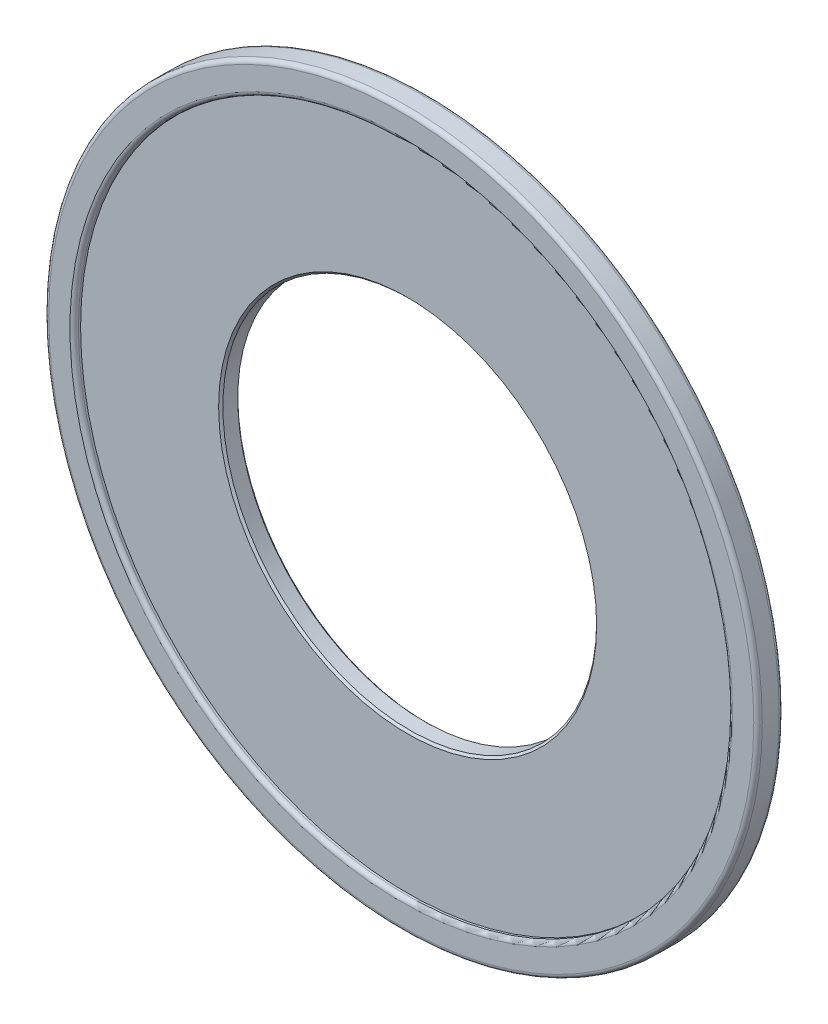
from build123d import *

# Parameters (mm, degrees)
SKETCH_1_R          = 84
SKETCH_1_R_2        = 44
EXTRUDE_1_DEPTH     = 6
SKETCH_2_R          = 77
CUT_EXTRUDE_1_DEPTH = 1.5
FILLET_1_R          = 1
CHAMFER_1_SIZE      = 0.5


with BuildPart() as part:
    # Sketch 1 → Extrude 1 (new body)
    with BuildSketch(Plane.XY):
        Circle(SKETCH_1_R)
        Circle(SKETCH_1_R_2, mode=Mode.SUBTRACT)
    extrude(amount=EXTRUDE_1_DEPTH)

    # Sketch 2 → Cut-Extrude 1 (cut)
    with BuildSketch(Plane.XY.offset(6)):
        Circle(SKETCH_2_R)
    extrude(amount=-CUT_EXTRUDE_1_DEPTH, mode=Mode.SUBTRACT)

    # Fillet 1
    fillet_1_edges = [part.edges().sort_by_distance(p)[0] for p in [
        (-77, 0, 6),
        (-84, 0, 0),
        (-84, 0, 6),
    ]]
    fillet(fillet_1_edges, radius=FILLET_1_R)

    # Chamfer 1
    chamfer_1_edges = [part.edges().sort_by_distance(p)[0] for p in [
        (-44, 0, 4.5),
        (-44, 0, 0),
    ]]
    chamfer(chamfer_1_edges, length=CHAMFER_1_SIZE)


solid = part.part
